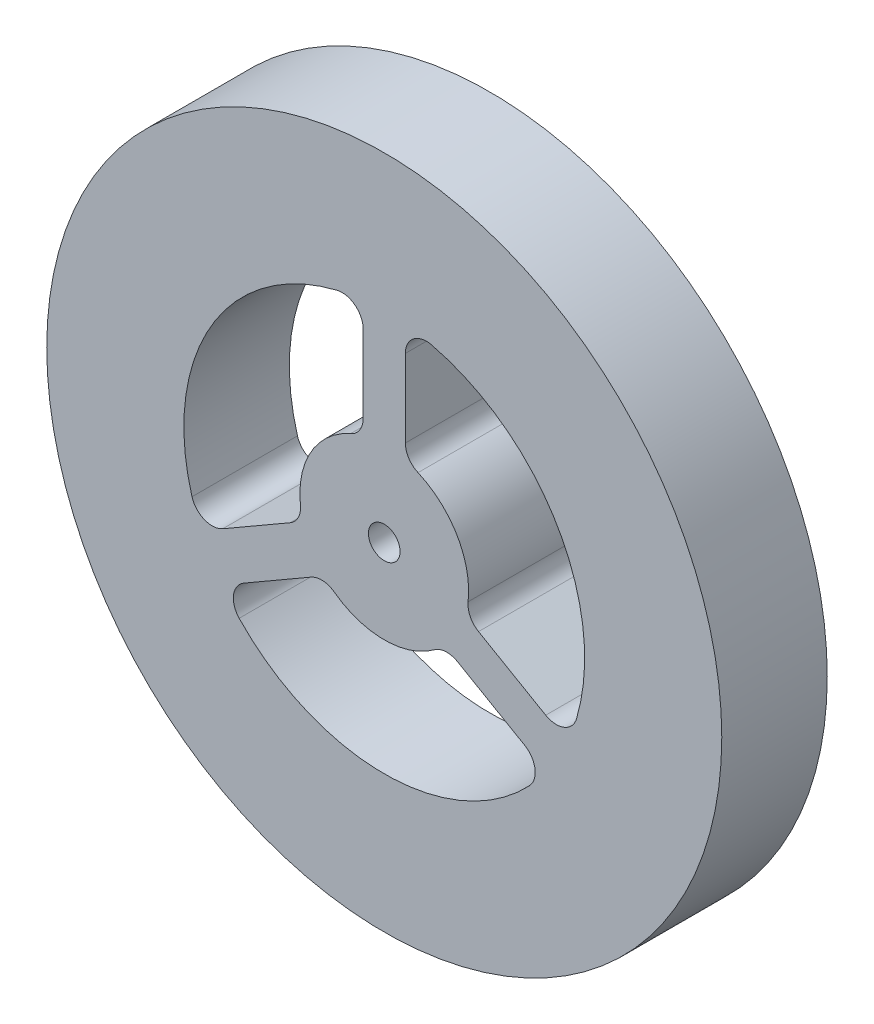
ISO-10303-21;
HEADER;
FILE_DESCRIPTION(('STEP AP214'),'2;1');
FILE_NAME('part.step','',(''),(''),'','','');
FILE_SCHEMA(('AUTOMOTIVE_DESIGN { 1 0 10303 214 1 1 1 1 }'));
ENDSEC;
DATA;
#1=APPLICATION_CONTEXT('core data for automotive mechanical design processes');
#2=APPLICATION_PROTOCOL_DEFINITION('international standard','automotive_design',2000,#1);
#3=PRODUCT_CONTEXT('',#1,'mechanical');
#4=PRODUCT('Part','Part','',(#3));
#5=PRODUCT_RELATED_PRODUCT_CATEGORY('part','',(#4));
#6=PRODUCT_DEFINITION_FORMATION('','',#4);
#7=PRODUCT_DEFINITION_CONTEXT('part definition',#1,'design');
#8=PRODUCT_DEFINITION('design','',#6,#7);
#9=PRODUCT_DEFINITION_SHAPE('','',#8);
#10=(LENGTH_UNIT() NAMED_UNIT(*) SI_UNIT(.MILLI.,.METRE.));
#11=(NAMED_UNIT(*) PLANE_ANGLE_UNIT() SI_UNIT($,.RADIAN.));
#12=(NAMED_UNIT(*) SI_UNIT($,.STERADIAN.) SOLID_ANGLE_UNIT());
#13=UNCERTAINTY_MEASURE_WITH_UNIT(LENGTH_MEASURE(1.E-05),#10,'distance_accuracy_value','');
#14=(GEOMETRIC_REPRESENTATION_CONTEXT(3) GLOBAL_UNCERTAINTY_ASSIGNED_CONTEXT((#13)) GLOBAL_UNIT_ASSIGNED_CONTEXT((#10,
#11,#12)) REPRESENTATION_CONTEXT('',''));
#15=CARTESIAN_POINT('',(0.,0.,0.));
#16=DIRECTION('',(0.,0.,1.));
#17=DIRECTION('',(1.,0.,0.));
#18=AXIS2_PLACEMENT_3D('',#15,#16,#17);
#19=CARTESIAN_POINT('',(0.,0.,5.));
#20=DIRECTION('',(0.,0.,1.));
#21=DIRECTION('',(1.,0.,0.));
#22=AXIS2_PLACEMENT_3D('',#19,#20,#21);
#23=PLANE('',#22);
#24=CARTESIAN_POINT('',(0.,0.,5.));
#25=DIRECTION('',(0.,0.,-1.));
#26=DIRECTION('',(1.,0.,0.));
#27=AXIS2_PLACEMENT_3D('',#24,#25,#26);
#28=CIRCLE('',#27,4.);
#29=CARTESIAN_POINT('',(-3.97490157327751,-0.447389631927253,5.));
#30=VERTEX_POINT('',#29);
#31=CARTESIAN_POINT('',(-1.6,3.66606055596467,5.));
#32=VERTEX_POINT('',#31);
#33=EDGE_CURVE('E261',#30,#32,#28,.T.);
#34=ORIENTED_EDGE('',*,*,#33,.F.);
#35=CARTESIAN_POINT('',(-4.96862696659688,-0.559237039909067,5.));
#36=DIRECTION('',(0.,0.,1.));
#37=DIRECTION('',(-1.,0.,0.));
#38=AXIS2_PLACEMENT_3D('',#35,#36,#37);
#39=CIRCLE('',#38,0.999999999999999);
#40=CARTESIAN_POINT('',(-4.46862696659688,-1.4252624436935,5.));
#41=VERTEX_POINT('',#40);
#42=EDGE_CURVE('E259',#41,#30,#39,.T.);
#43=ORIENTED_EDGE('',*,*,#42,.F.);
#44=DIRECTION('',(0.866025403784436,0.500000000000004,0.));
#45=VECTOR('',#44,1.);
#46=CARTESIAN_POINT('',(-7.65454401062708,-3.26465250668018,5.));
#47=LINE('',#46,#45);
#48=CARTESIAN_POINT('',(-7.65454401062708,-3.26465250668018,5.));
#49=VERTEX_POINT('',#48);
#50=EDGE_CURVE('E275',#49,#41,#47,.T.);
#51=ORIENTED_EDGE('',*,*,#50,.F.);
#52=CARTESIAN_POINT('',(-8.15454401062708,-2.39862710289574,5.));
#53=DIRECTION('',(0.,0.,1.));
#54=DIRECTION('',(-1.,0.,0.));
#55=AXIS2_PLACEMENT_3D('',#52,#53,#54);
#56=CIRCLE('',#55,1.);
#57=CARTESIAN_POINT('',(-9.11390212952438,-2.68081852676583,5.));
#58=VERTEX_POINT('',#57);
#59=EDGE_CURVE('E272',#58,#49,#56,.T.);
#60=ORIENTED_EDGE('',*,*,#59,.F.);
#61=CARTESIAN_POINT('',(0.,0.,5.));
#62=DIRECTION('',(0.,0.,1.));
#63=DIRECTION('',(1.,0.,0.));
#64=AXIS2_PLACEMENT_3D('',#61,#62,#63);
#65=CIRCLE('',#64,9.5);
#66=CARTESIAN_POINT('',(-2.23529411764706,9.23328003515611,5.));
#67=VERTEX_POINT('',#66);
#68=EDGE_CURVE('E270',#67,#58,#65,.T.);
#69=ORIENTED_EDGE('',*,*,#68,.F.);
#70=CARTESIAN_POINT('',(-2.,8.26135582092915,5.));
#71=DIRECTION('',(0.,0.,1.));
#72=DIRECTION('',(-1.,0.,0.));
#73=AXIS2_PLACEMENT_3D('',#70,#71,#72);
#74=CIRCLE('',#73,1.);
#75=CARTESIAN_POINT('',(-1.,8.26135582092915,5.));
#76=VERTEX_POINT('',#75);
#77=EDGE_CURVE('E268',#76,#67,#74,.T.);
#78=ORIENTED_EDGE('',*,*,#77,.F.);
#79=DIRECTION('',(0.,1.,0.));
#80=VECTOR('',#79,1.);
#81=CARTESIAN_POINT('',(-0.999999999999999,4.58257569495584,5.));
#82=LINE('',#81,#80);
#83=CARTESIAN_POINT('',(-0.999999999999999,4.58257569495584,5.));
#84=VERTEX_POINT('',#83);
#85=EDGE_CURVE('E266',#84,#76,#82,.T.);
#86=ORIENTED_EDGE('',*,*,#85,.F.);
#87=CARTESIAN_POINT('',(-2.,4.58257569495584,5.));
#88=DIRECTION('',(0.,0.,1.));
#89=DIRECTION('',(-1.,0.,0.));
#90=AXIS2_PLACEMENT_3D('',#87,#88,#89);
#91=CIRCLE('',#90,1.);
#92=EDGE_CURVE('E264',#32,#84,#91,.T.);
#93=ORIENTED_EDGE('',*,*,#92,.F.);
#94=EDGE_LOOP('',(#34,#43,#51,#60,#69,#78,#86,#93));
#95=FACE_BOUND('',#94,.T.);
#96=CARTESIAN_POINT('',(0.,0.,5.));
#97=DIRECTION('',(0.,0.,1.));
#98=DIRECTION('',(1.,0.,0.));
#99=AXIS2_PLACEMENT_3D('',#96,#97,#98);
#100=CIRCLE('',#99,0.75);
#101=CARTESIAN_POINT('',(0.75,0.,5.));
#102=VERTEX_POINT('',#101);
#103=EDGE_CURVE('E377',#102,#102,#100,.T.);
#104=ORIENTED_EDGE('',*,*,#103,.F.);
#105=EDGE_LOOP('',(#104));
#106=FACE_BOUND('',#105,.T.);
#107=CARTESIAN_POINT('',(0.,0.,5.));
#108=DIRECTION('',(0.,0.,1.));
#109=DIRECTION('',(1.,0.,0.));
#110=AXIS2_PLACEMENT_3D('',#107,#108,#109);
#111=CIRCLE('',#110,16.);
#112=CARTESIAN_POINT('',(16.,0.,5.));
#113=VERTEX_POINT('',#112);
#114=EDGE_CURVE('E11',#113,#113,#111,.T.);
#115=ORIENTED_EDGE('',*,*,#114,.T.);
#116=EDGE_LOOP('',(#115));
#117=FACE_BOUND('',#116,.T.);
#118=DIRECTION('',(-0.866025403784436,0.500000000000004,0.));
#119=VECTOR('',#118,1.);
#120=CARTESIAN_POINT('',(3.46862696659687,-3.15731325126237,5.));
#121=LINE('',#120,#119);
#122=CARTESIAN_POINT('',(6.65454401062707,-4.99670331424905,5.));
#123=VERTEX_POINT('',#122);
#124=CARTESIAN_POINT('',(3.46862696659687,-3.15731325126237,5.));
#125=VERTEX_POINT('',#124);
#126=EDGE_CURVE('E320',#123,#125,#121,.T.);
#127=ORIENTED_EDGE('',*,*,#126,.F.);
#128=CARTESIAN_POINT('',(6.15454401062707,-5.86272871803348,5.));
#129=DIRECTION('',(0.,0.,1.));
#130=DIRECTION('',(1.,0.,0.));
#131=AXIS2_PLACEMENT_3D('',#128,#129,#130);
#132=CIRCLE('',#131,1.);
#133=CARTESIAN_POINT('',(6.87860801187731,-6.55246150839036,5.));
#134=VERTEX_POINT('',#133);
#135=EDGE_CURVE('E318',#134,#123,#132,.T.);
#136=ORIENTED_EDGE('',*,*,#135,.F.);
#137=CARTESIAN_POINT('',(0.,0.,5.));
#138=DIRECTION('',(0.,0.,1.));
#139=DIRECTION('',(1.,0.,0.));
#140=AXIS2_PLACEMENT_3D('',#137,#138,#139);
#141=CIRCLE('',#140,9.5);
#142=CARTESIAN_POINT('',(-6.87860801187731,-6.55246150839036,5.));
#143=VERTEX_POINT('',#142);
#144=EDGE_CURVE('E334',#143,#134,#141,.T.);
#145=ORIENTED_EDGE('',*,*,#144,.F.);
#146=CARTESIAN_POINT('',(-6.15454401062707,-5.86272871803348,5.));
#147=DIRECTION('',(0.,0.,1.));
#148=DIRECTION('',(-1.,0.,0.));
#149=AXIS2_PLACEMENT_3D('',#146,#147,#148);
#150=CIRCLE('',#149,0.999999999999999);
#151=CARTESIAN_POINT('',(-6.65454401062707,-4.99670331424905,5.));
#152=VERTEX_POINT('',#151);
#153=EDGE_CURVE('E331',#152,#143,#150,.T.);
#154=ORIENTED_EDGE('',*,*,#153,.F.);
#155=DIRECTION('',(-0.866025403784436,-0.500000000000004,0.));
#156=VECTOR('',#155,1.);
#157=CARTESIAN_POINT('',(-6.65454401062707,-4.99670331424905,5.));
#158=LINE('',#157,#156);
#159=CARTESIAN_POINT('',(-3.46862696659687,-3.15731325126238,5.));
#160=VERTEX_POINT('',#159);
#161=EDGE_CURVE('E329',#160,#152,#158,.T.);
#162=ORIENTED_EDGE('',*,*,#161,.F.);
#163=CARTESIAN_POINT('',(-2.96862696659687,-4.02333865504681,5.));
#164=DIRECTION('',(0.,0.,1.));
#165=DIRECTION('',(1.,0.,0.));
#166=AXIS2_PLACEMENT_3D('',#163,#164,#165);
#167=CIRCLE('',#166,1.);
#168=CARTESIAN_POINT('',(-2.37490157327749,-3.21867092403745,5.));
#169=VERTEX_POINT('',#168);
#170=EDGE_CURVE('E327',#169,#160,#167,.T.);
#171=ORIENTED_EDGE('',*,*,#170,.F.);
#172=CARTESIAN_POINT('',(0.,0.,5.));
#173=DIRECTION('',(0.,0.,-1.));
#174=DIRECTION('',(1.,0.,0.));
#175=AXIS2_PLACEMENT_3D('',#172,#173,#174);
#176=CIRCLE('',#175,4.);
#177=CARTESIAN_POINT('',(2.37490157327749,-3.21867092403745,5.));
#178=VERTEX_POINT('',#177);
#179=EDGE_CURVE('E325',#178,#169,#176,.T.);
#180=ORIENTED_EDGE('',*,*,#179,.F.);
#181=CARTESIAN_POINT('',(2.96862696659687,-4.02333865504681,5.));
#182=DIRECTION('',(0.,0.,1.));
#183=DIRECTION('',(1.,0.,0.));
#184=AXIS2_PLACEMENT_3D('',#181,#182,#183);
#185=CIRCLE('',#184,1.);
#186=EDGE_CURVE('E323',#125,#178,#185,.T.);
#187=ORIENTED_EDGE('',*,*,#186,.F.);
#188=EDGE_LOOP('',(#127,#136,#145,#154,#162,#171,#180,#187));
#189=FACE_BOUND('',#188,.T.);
#190=CARTESIAN_POINT('',(0.,0.,5.));
#191=DIRECTION('',(0.,0.,-1.));
#192=DIRECTION('',(-1.,0.,0.));
#193=AXIS2_PLACEMENT_3D('',#190,#191,#192);
#194=CIRCLE('',#193,4.);
#195=CARTESIAN_POINT('',(1.6,3.66606055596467,5.));
#196=VERTEX_POINT('',#195);
#197=CARTESIAN_POINT('',(3.97490157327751,-0.447389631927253,5.));
#198=VERTEX_POINT('',#197);
#199=EDGE_CURVE('E202',#196,#198,#194,.T.);
#200=ORIENTED_EDGE('',*,*,#199,.F.);
#201=CARTESIAN_POINT('',(2.,4.58257569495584,5.));
#202=DIRECTION('',(0.,0.,1.));
#203=DIRECTION('',(1.,0.,0.));
#204=AXIS2_PLACEMENT_3D('',#201,#202,#203);
#205=CIRCLE('',#204,1.);
#206=CARTESIAN_POINT('',(1.,4.58257569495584,5.));
#207=VERTEX_POINT('',#206);
#208=EDGE_CURVE('E194',#207,#196,#205,.T.);
#209=ORIENTED_EDGE('',*,*,#208,.F.);
#210=DIRECTION('',(0.,-1.,0.));
#211=VECTOR('',#210,1.);
#212=CARTESIAN_POINT('',(1.,8.26135582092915,5.));
#213=LINE('',#212,#211);
#214=CARTESIAN_POINT('',(1.,8.26135582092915,5.));
#215=VERTEX_POINT('',#214);
#216=EDGE_CURVE('E227',#215,#207,#213,.T.);
#217=ORIENTED_EDGE('',*,*,#216,.F.);
#218=CARTESIAN_POINT('',(2.,8.26135582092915,5.));
#219=DIRECTION('',(0.,0.,1.));
#220=DIRECTION('',(1.,0.,0.));
#221=AXIS2_PLACEMENT_3D('',#218,#219,#220);
#222=CIRCLE('',#221,0.999999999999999);
#223=CARTESIAN_POINT('',(2.23529411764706,9.23328003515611,5.));
#224=VERTEX_POINT('',#223);
#225=EDGE_CURVE('E225',#224,#215,#222,.T.);
#226=ORIENTED_EDGE('',*,*,#225,.F.);
#227=CARTESIAN_POINT('',(0.,0.,5.));
#228=DIRECTION('',(0.,0.,1.));
#229=DIRECTION('',(-1.,0.,0.));
#230=AXIS2_PLACEMENT_3D('',#227,#228,#229);
#231=CIRCLE('',#230,9.5);
#232=CARTESIAN_POINT('',(9.11390212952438,-2.68081852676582,5.));
#233=VERTEX_POINT('',#232);
#234=EDGE_CURVE('E223',#233,#224,#231,.T.);
#235=ORIENTED_EDGE('',*,*,#234,.F.);
#236=CARTESIAN_POINT('',(8.15454401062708,-2.39862710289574,5.));
#237=DIRECTION('',(0.,0.,1.));
#238=DIRECTION('',(1.,0.,0.));
#239=AXIS2_PLACEMENT_3D('',#236,#237,#238);
#240=CIRCLE('',#239,0.999999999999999);
#241=CARTESIAN_POINT('',(7.65454401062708,-3.26465250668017,5.));
#242=VERTEX_POINT('',#241);
#243=EDGE_CURVE('E221',#242,#233,#240,.T.);
#244=ORIENTED_EDGE('',*,*,#243,.F.);
#245=DIRECTION('',(0.866025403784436,-0.500000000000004,0.));
#246=VECTOR('',#245,1.);
#247=CARTESIAN_POINT('',(4.46862696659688,-1.4252624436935,5.));
#248=LINE('',#247,#246);
#249=CARTESIAN_POINT('',(4.46862696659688,-1.4252624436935,5.));
#250=VERTEX_POINT('',#249);
#251=EDGE_CURVE('E217',#250,#242,#248,.T.);
#252=ORIENTED_EDGE('',*,*,#251,.F.);
#253=CARTESIAN_POINT('',(4.96862696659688,-0.559237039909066,5.));
#254=DIRECTION('',(0.,0.,1.));
#255=DIRECTION('',(1.,0.,0.));
#256=AXIS2_PLACEMENT_3D('',#253,#254,#255);
#257=CIRCLE('',#256,1.);
#258=EDGE_CURVE('E215',#198,#250,#257,.T.);
#259=ORIENTED_EDGE('',*,*,#258,.F.);
#260=EDGE_LOOP('',(#200,#209,#217,#226,#235,#244,#252,#259));
#261=FACE_BOUND('',#260,.T.);
#262=ADVANCED_FACE('F33',(#95,#106,#117,#189,#261),#23,.T.);
#263=CARTESIAN_POINT('',(0.,0.,0.));
#264=DIRECTION('',(0.,0.,1.));
#265=DIRECTION('',(1.,0.,0.));
#266=AXIS2_PLACEMENT_3D('',#263,#264,#265);
#267=PLANE('',#266);
#268=CARTESIAN_POINT('',(-4.96862696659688,-0.559237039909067,0.));
#269=DIRECTION('',(0.,0.,1.));
#270=DIRECTION('',(-1.,0.,0.));
#271=AXIS2_PLACEMENT_3D('',#268,#269,#270);
#272=CIRCLE('',#271,0.999999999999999);
#273=CARTESIAN_POINT('',(-4.46862696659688,-1.4252624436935,0.));
#274=VERTEX_POINT('',#273);
#275=CARTESIAN_POINT('',(-3.97490157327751,-0.447389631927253,0.));
#276=VERTEX_POINT('',#275);
#277=EDGE_CURVE('E210',#274,#276,#272,.T.);
#278=ORIENTED_EDGE('',*,*,#277,.T.);
#279=CARTESIAN_POINT('',(0.,0.,0.));
#280=DIRECTION('',(0.,0.,-1.));
#281=DIRECTION('',(1.,0.,0.));
#282=AXIS2_PLACEMENT_3D('',#279,#280,#281);
#283=CIRCLE('',#282,4.);
#284=CARTESIAN_POINT('',(-1.6,3.66606055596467,0.));
#285=VERTEX_POINT('',#284);
#286=EDGE_CURVE('E280',#276,#285,#283,.T.);
#287=ORIENTED_EDGE('',*,*,#286,.T.);
#288=CARTESIAN_POINT('',(-2.,4.58257569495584,0.));
#289=DIRECTION('',(0.,0.,1.));
#290=DIRECTION('',(-1.,0.,0.));
#291=AXIS2_PLACEMENT_3D('',#288,#289,#290);
#292=CIRCLE('',#291,1.);
#293=CARTESIAN_POINT('',(-0.999999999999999,4.58257569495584,0.));
#294=VERTEX_POINT('',#293);
#295=EDGE_CURVE('E283',#285,#294,#292,.T.);
#296=ORIENTED_EDGE('',*,*,#295,.T.);
#297=DIRECTION('',(0.,1.,0.));
#298=VECTOR('',#297,1.);
#299=CARTESIAN_POINT('',(-0.999999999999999,4.58257569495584,0.));
#300=LINE('',#299,#298);
#301=CARTESIAN_POINT('',(-1.,8.26135582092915,0.));
#302=VERTEX_POINT('',#301);
#303=EDGE_CURVE('E286',#294,#302,#300,.T.);
#304=ORIENTED_EDGE('',*,*,#303,.T.);
#305=CARTESIAN_POINT('',(-2.,8.26135582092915,0.));
#306=DIRECTION('',(0.,0.,1.));
#307=DIRECTION('',(-1.,0.,0.));
#308=AXIS2_PLACEMENT_3D('',#305,#306,#307);
#309=CIRCLE('',#308,1.);
#310=CARTESIAN_POINT('',(-2.23529411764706,9.23328003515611,0.));
#311=VERTEX_POINT('',#310);
#312=EDGE_CURVE('E289',#302,#311,#309,.T.);
#313=ORIENTED_EDGE('',*,*,#312,.T.);
#314=CARTESIAN_POINT('',(0.,0.,0.));
#315=DIRECTION('',(0.,0.,1.));
#316=DIRECTION('',(1.,0.,0.));
#317=AXIS2_PLACEMENT_3D('',#314,#315,#316);
#318=CIRCLE('',#317,9.5);
#319=CARTESIAN_POINT('',(-9.11390212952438,-2.68081852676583,0.));
#320=VERTEX_POINT('',#319);
#321=EDGE_CURVE('E292',#311,#320,#318,.T.);
#322=ORIENTED_EDGE('',*,*,#321,.T.);
#323=CARTESIAN_POINT('',(-8.15454401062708,-2.39862710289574,0.));
#324=DIRECTION('',(0.,0.,1.));
#325=DIRECTION('',(-1.,0.,0.));
#326=AXIS2_PLACEMENT_3D('',#323,#324,#325);
#327=CIRCLE('',#326,1.);
#328=CARTESIAN_POINT('',(-7.65454401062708,-3.26465250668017,0.));
#329=VERTEX_POINT('',#328);
#330=EDGE_CURVE('E295',#320,#329,#327,.T.);
#331=ORIENTED_EDGE('',*,*,#330,.T.);
#332=DIRECTION('',(0.866025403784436,0.500000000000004,0.));
#333=VECTOR('',#332,1.);
#334=CARTESIAN_POINT('',(-7.65454401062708,-3.26465250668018,0.));
#335=LINE('',#334,#333);
#336=EDGE_CURVE('E262',#329,#274,#335,.T.);
#337=ORIENTED_EDGE('',*,*,#336,.T.);
#338=EDGE_LOOP('',(#278,#287,#296,#304,#313,#322,#331,#337));
#339=FACE_BOUND('',#338,.T.);
#340=CARTESIAN_POINT('',(0.,0.,0.));
#341=DIRECTION('',(0.,0.,1.));
#342=DIRECTION('',(1.,0.,0.));
#343=AXIS2_PLACEMENT_3D('',#340,#341,#342);
#344=CIRCLE('',#343,0.75);
#345=CARTESIAN_POINT('',(0.75,0.,0.));
#346=VERTEX_POINT('',#345);
#347=EDGE_CURVE('E376',#346,#346,#344,.T.);
#348=ORIENTED_EDGE('',*,*,#347,.T.);
#349=EDGE_LOOP('',(#348));
#350=FACE_BOUND('',#349,.T.);
#351=CARTESIAN_POINT('',(0.,0.,0.));
#352=DIRECTION('',(0.,0.,1.));
#353=DIRECTION('',(1.,0.,0.));
#354=AXIS2_PLACEMENT_3D('',#351,#352,#353);
#355=CIRCLE('',#354,16.);
#356=CARTESIAN_POINT('',(16.,0.,0.));
#357=VERTEX_POINT('',#356);
#358=EDGE_CURVE('E37',#357,#357,#355,.T.);
#359=ORIENTED_EDGE('',*,*,#358,.F.);
#360=EDGE_LOOP('',(#359));
#361=FACE_BOUND('',#360,.T.);
#362=CARTESIAN_POINT('',(6.15454401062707,-5.86272871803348,0.));
#363=DIRECTION('',(0.,0.,1.));
#364=DIRECTION('',(1.,0.,0.));
#365=AXIS2_PLACEMENT_3D('',#362,#363,#364);
#366=CIRCLE('',#365,1.);
#367=CARTESIAN_POINT('',(6.87860801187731,-6.55246150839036,0.));
#368=VERTEX_POINT('',#367);
#369=CARTESIAN_POINT('',(6.65454401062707,-4.99670331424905,0.));
#370=VERTEX_POINT('',#369);
#371=EDGE_CURVE('E317',#368,#370,#366,.T.);
#372=ORIENTED_EDGE('',*,*,#371,.T.);
#373=DIRECTION('',(-0.866025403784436,0.500000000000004,0.));
#374=VECTOR('',#373,1.);
#375=CARTESIAN_POINT('',(3.46862696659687,-3.15731325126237,0.));
#376=LINE('',#375,#374);
#377=CARTESIAN_POINT('',(3.46862696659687,-3.15731325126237,0.));
#378=VERTEX_POINT('',#377);
#379=EDGE_CURVE('E339',#370,#378,#376,.T.);
#380=ORIENTED_EDGE('',*,*,#379,.T.);
#381=CARTESIAN_POINT('',(2.96862696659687,-4.02333865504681,0.));
#382=DIRECTION('',(0.,0.,1.));
#383=DIRECTION('',(1.,0.,0.));
#384=AXIS2_PLACEMENT_3D('',#381,#382,#383);
#385=CIRCLE('',#384,1.);
#386=CARTESIAN_POINT('',(2.37490157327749,-3.21867092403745,0.));
#387=VERTEX_POINT('',#386);
#388=EDGE_CURVE('E342',#378,#387,#385,.T.);
#389=ORIENTED_EDGE('',*,*,#388,.T.);
#390=CARTESIAN_POINT('',(0.,0.,0.));
#391=DIRECTION('',(0.,0.,-1.));
#392=DIRECTION('',(1.,0.,0.));
#393=AXIS2_PLACEMENT_3D('',#390,#391,#392);
#394=CIRCLE('',#393,4.);
#395=CARTESIAN_POINT('',(-2.37490157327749,-3.21867092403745,0.));
#396=VERTEX_POINT('',#395);
#397=EDGE_CURVE('E345',#387,#396,#394,.T.);
#398=ORIENTED_EDGE('',*,*,#397,.T.);
#399=CARTESIAN_POINT('',(-2.96862696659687,-4.02333865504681,0.));
#400=DIRECTION('',(0.,0.,1.));
#401=DIRECTION('',(1.,0.,0.));
#402=AXIS2_PLACEMENT_3D('',#399,#400,#401);
#403=CIRCLE('',#402,1.);
#404=CARTESIAN_POINT('',(-3.46862696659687,-3.15731325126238,0.));
#405=VERTEX_POINT('',#404);
#406=EDGE_CURVE('E348',#396,#405,#403,.T.);
#407=ORIENTED_EDGE('',*,*,#406,.T.);
#408=DIRECTION('',(-0.866025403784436,-0.500000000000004,0.));
#409=VECTOR('',#408,1.);
#410=CARTESIAN_POINT('',(-6.65454401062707,-4.99670331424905,0.));
#411=LINE('',#410,#409);
#412=CARTESIAN_POINT('',(-6.65454401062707,-4.99670331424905,0.));
#413=VERTEX_POINT('',#412);
#414=EDGE_CURVE('E351',#405,#413,#411,.T.);
#415=ORIENTED_EDGE('',*,*,#414,.T.);
#416=CARTESIAN_POINT('',(-6.15454401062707,-5.86272871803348,0.));
#417=DIRECTION('',(0.,0.,1.));
#418=DIRECTION('',(-1.,0.,0.));
#419=AXIS2_PLACEMENT_3D('',#416,#417,#418);
#420=CIRCLE('',#419,0.999999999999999);
#421=CARTESIAN_POINT('',(-6.87860801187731,-6.55246150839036,0.));
#422=VERTEX_POINT('',#421);
#423=EDGE_CURVE('E354',#413,#422,#420,.T.);
#424=ORIENTED_EDGE('',*,*,#423,.T.);
#425=CARTESIAN_POINT('',(0.,0.,0.));
#426=DIRECTION('',(0.,0.,1.));
#427=DIRECTION('',(1.,0.,0.));
#428=AXIS2_PLACEMENT_3D('',#425,#426,#427);
#429=CIRCLE('',#428,9.5);
#430=EDGE_CURVE('E321',#422,#368,#429,.T.);
#431=ORIENTED_EDGE('',*,*,#430,.T.);
#432=EDGE_LOOP('',(#372,#380,#389,#398,#407,#415,#424,#431));
#433=FACE_BOUND('',#432,.T.);
#434=CARTESIAN_POINT('',(2.,4.58257569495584,0.));
#435=DIRECTION('',(0.,0.,1.));
#436=DIRECTION('',(1.,0.,0.));
#437=AXIS2_PLACEMENT_3D('',#434,#435,#436);
#438=CIRCLE('',#437,1.);
#439=CARTESIAN_POINT('',(1.,4.58257569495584,0.));
#440=VERTEX_POINT('',#439);
#441=CARTESIAN_POINT('',(1.6,3.66606055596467,0.));
#442=VERTEX_POINT('',#441);
#443=EDGE_CURVE('E56',#440,#442,#438,.T.);
#444=ORIENTED_EDGE('',*,*,#443,.T.);
#445=CARTESIAN_POINT('',(0.,0.,0.));
#446=DIRECTION('',(0.,0.,-1.));
#447=DIRECTION('',(-1.,0.,0.));
#448=AXIS2_PLACEMENT_3D('',#445,#446,#447);
#449=CIRCLE('',#448,4.);
#450=CARTESIAN_POINT('',(3.97490157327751,-0.447389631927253,0.));
#451=VERTEX_POINT('',#450);
#452=EDGE_CURVE('E209',#442,#451,#449,.T.);
#453=ORIENTED_EDGE('',*,*,#452,.T.);
#454=CARTESIAN_POINT('',(4.96862696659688,-0.559237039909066,0.));
#455=DIRECTION('',(0.,0.,1.));
#456=DIRECTION('',(1.,0.,0.));
#457=AXIS2_PLACEMENT_3D('',#454,#455,#456);
#458=CIRCLE('',#457,1.);
#459=CARTESIAN_POINT('',(4.46862696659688,-1.4252624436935,0.));
#460=VERTEX_POINT('',#459);
#461=EDGE_CURVE('E231',#451,#460,#458,.T.);
#462=ORIENTED_EDGE('',*,*,#461,.T.);
#463=DIRECTION('',(0.866025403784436,-0.500000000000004,0.));
#464=VECTOR('',#463,1.);
#465=CARTESIAN_POINT('',(4.46862696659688,-1.4252624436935,0.));
#466=LINE('',#465,#464);
#467=CARTESIAN_POINT('',(7.65454401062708,-3.26465250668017,0.));
#468=VERTEX_POINT('',#467);
#469=EDGE_CURVE('E234',#460,#468,#466,.T.);
#470=ORIENTED_EDGE('',*,*,#469,.T.);
#471=CARTESIAN_POINT('',(8.15454401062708,-2.39862710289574,0.));
#472=DIRECTION('',(0.,0.,1.));
#473=DIRECTION('',(1.,0.,0.));
#474=AXIS2_PLACEMENT_3D('',#471,#472,#473);
#475=CIRCLE('',#474,0.999999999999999);
#476=CARTESIAN_POINT('',(9.11390212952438,-2.68081852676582,0.));
#477=VERTEX_POINT('',#476);
#478=EDGE_CURVE('E237',#468,#477,#475,.T.);
#479=ORIENTED_EDGE('',*,*,#478,.T.);
#480=CARTESIAN_POINT('',(0.,0.,0.));
#481=DIRECTION('',(0.,0.,1.));
#482=DIRECTION('',(-1.,0.,0.));
#483=AXIS2_PLACEMENT_3D('',#480,#481,#482);
#484=CIRCLE('',#483,9.5);
#485=CARTESIAN_POINT('',(2.23529411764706,9.23328003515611,0.));
#486=VERTEX_POINT('',#485);
#487=EDGE_CURVE('E240',#477,#486,#484,.T.);
#488=ORIENTED_EDGE('',*,*,#487,.T.);
#489=CARTESIAN_POINT('',(2.,8.26135582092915,0.));
#490=DIRECTION('',(0.,0.,1.));
#491=DIRECTION('',(1.,0.,0.));
#492=AXIS2_PLACEMENT_3D('',#489,#490,#491);
#493=CIRCLE('',#492,0.999999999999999);
#494=CARTESIAN_POINT('',(1.,8.26135582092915,0.));
#495=VERTEX_POINT('',#494);
#496=EDGE_CURVE('E243',#486,#495,#493,.T.);
#497=ORIENTED_EDGE('',*,*,#496,.T.);
#498=DIRECTION('',(0.,-1.,0.));
#499=VECTOR('',#498,1.);
#500=CARTESIAN_POINT('',(1.,8.26135582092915,0.));
#501=LINE('',#500,#499);
#502=EDGE_CURVE('E203',#495,#440,#501,.T.);
#503=ORIENTED_EDGE('',*,*,#502,.T.);
#504=EDGE_LOOP('',(#444,#453,#462,#470,#479,#488,#497,#503));
#505=FACE_BOUND('',#504,.T.);
#506=ADVANCED_FACE('F383',(#339,#350,#361,#433,#505),#267,.F.);
#507=CARTESIAN_POINT('',(0.,0.,5.));
#508=DIRECTION('',(0.,0.,-1.));
#509=DIRECTION('',(-1.,0.,0.));
#510=AXIS2_PLACEMENT_3D('',#507,#508,#509);
#511=CYLINDRICAL_SURFACE('',#510,16.);
#512=ORIENTED_EDGE('',*,*,#114,.F.);
#513=EDGE_LOOP('',(#512));
#514=FACE_BOUND('',#513,.T.);
#515=ORIENTED_EDGE('',*,*,#358,.T.);
#516=EDGE_LOOP('',(#515));
#517=FACE_BOUND('',#516,.T.);
#518=ADVANCED_FACE('F35',(#514,#517),#511,.T.);
#519=CARTESIAN_POINT('',(0.,0.,5.));
#520=DIRECTION('',(0.,0.,-1.));
#521=DIRECTION('',(-1.,0.,0.));
#522=AXIS2_PLACEMENT_3D('',#519,#520,#521);
#523=CYLINDRICAL_SURFACE('',#522,0.75);
#524=ORIENTED_EDGE('',*,*,#103,.T.);
#525=EDGE_LOOP('',(#524));
#526=FACE_BOUND('',#525,.T.);
#527=ORIENTED_EDGE('',*,*,#347,.F.);
#528=EDGE_LOOP('',(#527));
#529=FACE_BOUND('',#528,.T.);
#530=ADVANCED_FACE('F386',(#526,#529),#523,.F.);
#531=CARTESIAN_POINT('',(6.15454401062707,-5.86272871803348,5.));
#532=DIRECTION('',(0.,0.,-1.));
#533=DIRECTION('',(-1.,0.,0.));
#534=AXIS2_PLACEMENT_3D('',#531,#532,#533);
#535=CYLINDRICAL_SURFACE('',#534,1.);
#536=ORIENTED_EDGE('',*,*,#371,.F.);
#537=DIRECTION('',(0.,0.,-1.));
#538=VECTOR('',#537,1.);
#539=CARTESIAN_POINT('',(6.87860801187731,-6.55246150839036,5.));
#540=LINE('',#539,#538);
#541=EDGE_CURVE('E336',#134,#368,#540,.T.);
#542=ORIENTED_EDGE('',*,*,#541,.F.);
#543=ORIENTED_EDGE('',*,*,#135,.T.);
#544=DIRECTION('',(0.,0.,-1.));
#545=VECTOR('',#544,1.);
#546=CARTESIAN_POINT('',(6.65454401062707,-4.99670331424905,5.));
#547=LINE('',#546,#545);
#548=EDGE_CURVE('E373',#123,#370,#547,.T.);
#549=ORIENTED_EDGE('',*,*,#548,.T.);
#550=EDGE_LOOP('',(#536,#542,#543,#549));
#551=FACE_BOUND('',#550,.T.);
#552=ADVANCED_FACE('F388',(#551),#535,.F.);
#553=CARTESIAN_POINT('',(3.46862696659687,-3.15731325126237,5.));
#554=DIRECTION('',(-0.500000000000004,-0.866025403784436,0.));
#555=DIRECTION('',(0.866025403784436,-0.500000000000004,0.));
#556=AXIS2_PLACEMENT_3D('',#553,#554,#555);
#557=PLANE('',#556);
#558=ORIENTED_EDGE('',*,*,#379,.F.);
#559=ORIENTED_EDGE('',*,*,#548,.F.);
#560=ORIENTED_EDGE('',*,*,#126,.T.);
#561=DIRECTION('',(0.,0.,-1.));
#562=VECTOR('',#561,1.);
#563=CARTESIAN_POINT('',(3.46862696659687,-3.15731325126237,5.));
#564=LINE('',#563,#562);
#565=EDGE_CURVE('E371',#125,#378,#564,.T.);
#566=ORIENTED_EDGE('',*,*,#565,.T.);
#567=EDGE_LOOP('',(#558,#559,#560,#566));
#568=FACE_BOUND('',#567,.T.);
#569=ADVANCED_FACE('F395',(#568),#557,.T.);
#570=CARTESIAN_POINT('',(2.96862696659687,-4.02333865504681,5.));
#571=DIRECTION('',(0.,0.,-1.));
#572=DIRECTION('',(-1.,0.,0.));
#573=AXIS2_PLACEMENT_3D('',#570,#571,#572);
#574=CYLINDRICAL_SURFACE('',#573,1.);
#575=ORIENTED_EDGE('',*,*,#388,.F.);
#576=ORIENTED_EDGE('',*,*,#565,.F.);
#577=ORIENTED_EDGE('',*,*,#186,.T.);
#578=DIRECTION('',(0.,0.,-1.));
#579=VECTOR('',#578,1.);
#580=CARTESIAN_POINT('',(2.37490157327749,-3.21867092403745,5.));
#581=LINE('',#580,#579);
#582=EDGE_CURVE('E369',#178,#387,#581,.T.);
#583=ORIENTED_EDGE('',*,*,#582,.T.);
#584=EDGE_LOOP('',(#575,#576,#577,#583));
#585=FACE_BOUND('',#584,.T.);
#586=ADVANCED_FACE('F424',(#585),#574,.F.);
#587=CARTESIAN_POINT('',(0.,0.,5.));
#588=DIRECTION('',(0.,0.,-1.));
#589=DIRECTION('',(-1.,0.,0.));
#590=AXIS2_PLACEMENT_3D('',#587,#588,#589);
#591=CYLINDRICAL_SURFACE('',#590,4.);
#592=ORIENTED_EDGE('',*,*,#397,.F.);
#593=ORIENTED_EDGE('',*,*,#582,.F.);
#594=ORIENTED_EDGE('',*,*,#179,.T.);
#595=DIRECTION('',(0.,0.,-1.));
#596=VECTOR('',#595,1.);
#597=CARTESIAN_POINT('',(-2.37490157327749,-3.21867092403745,5.));
#598=LINE('',#597,#596);
#599=EDGE_CURVE('E367',#169,#396,#598,.T.);
#600=ORIENTED_EDGE('',*,*,#599,.T.);
#601=EDGE_LOOP('',(#592,#593,#594,#600));
#602=FACE_BOUND('',#601,.T.);
#603=ADVANCED_FACE('F449',(#602),#591,.T.);
#604=CARTESIAN_POINT('',(-2.96862696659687,-4.02333865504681,5.));
#605=DIRECTION('',(0.,0.,-1.));
#606=DIRECTION('',(-1.,0.,0.));
#607=AXIS2_PLACEMENT_3D('',#604,#605,#606);
#608=CYLINDRICAL_SURFACE('',#607,1.);
#609=ORIENTED_EDGE('',*,*,#406,.F.);
#610=ORIENTED_EDGE('',*,*,#599,.F.);
#611=ORIENTED_EDGE('',*,*,#170,.T.);
#612=DIRECTION('',(0.,0.,-1.));
#613=VECTOR('',#612,1.);
#614=CARTESIAN_POINT('',(-3.46862696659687,-3.15731325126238,5.));
#615=LINE('',#614,#613);
#616=EDGE_CURVE('E365',#160,#405,#615,.T.);
#617=ORIENTED_EDGE('',*,*,#616,.T.);
#618=EDGE_LOOP('',(#609,#610,#611,#617));
#619=FACE_BOUND('',#618,.T.);
#620=ADVANCED_FACE('F446',(#619),#608,.F.);
#621=CARTESIAN_POINT('',(-6.65454401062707,-4.99670331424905,5.));
#622=DIRECTION('',(0.500000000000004,-0.866025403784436,0.));
#623=DIRECTION('',(0.866025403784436,0.500000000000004,0.));
#624=AXIS2_PLACEMENT_3D('',#621,#622,#623);
#625=PLANE('',#624);
#626=ORIENTED_EDGE('',*,*,#414,.F.);
#627=ORIENTED_EDGE('',*,*,#616,.F.);
#628=ORIENTED_EDGE('',*,*,#161,.T.);
#629=DIRECTION('',(0.,0.,-1.));
#630=VECTOR('',#629,1.);
#631=CARTESIAN_POINT('',(-6.65454401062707,-4.99670331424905,5.));
#632=LINE('',#631,#630);
#633=EDGE_CURVE('E363',#152,#413,#632,.T.);
#634=ORIENTED_EDGE('',*,*,#633,.T.);
#635=EDGE_LOOP('',(#626,#627,#628,#634));
#636=FACE_BOUND('',#635,.T.);
#637=ADVANCED_FACE('F443',(#636),#625,.T.);
#638=CARTESIAN_POINT('',(-6.15454401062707,-5.86272871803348,5.));
#639=DIRECTION('',(0.,0.,-1.));
#640=DIRECTION('',(-1.,0.,0.));
#641=AXIS2_PLACEMENT_3D('',#638,#639,#640);
#642=CYLINDRICAL_SURFACE('',#641,0.999999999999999);
#643=ORIENTED_EDGE('',*,*,#423,.F.);
#644=ORIENTED_EDGE('',*,*,#633,.F.);
#645=ORIENTED_EDGE('',*,*,#153,.T.);
#646=DIRECTION('',(0.,0.,-1.));
#647=VECTOR('',#646,1.);
#648=CARTESIAN_POINT('',(-6.87860801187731,-6.55246150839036,5.));
#649=LINE('',#648,#647);
#650=EDGE_CURVE('E361',#143,#422,#649,.T.);
#651=ORIENTED_EDGE('',*,*,#650,.T.);
#652=EDGE_LOOP('',(#643,#644,#645,#651));
#653=FACE_BOUND('',#652,.T.);
#654=ADVANCED_FACE('F437',(#653),#642,.F.);
#655=CARTESIAN_POINT('',(0.,0.,5.));
#656=DIRECTION('',(0.,0.,-1.));
#657=DIRECTION('',(-1.,0.,0.));
#658=AXIS2_PLACEMENT_3D('',#655,#656,#657);
#659=CYLINDRICAL_SURFACE('',#658,9.5);
#660=ORIENTED_EDGE('',*,*,#430,.F.);
#661=ORIENTED_EDGE('',*,*,#650,.F.);
#662=ORIENTED_EDGE('',*,*,#144,.T.);
#663=ORIENTED_EDGE('',*,*,#541,.T.);
#664=EDGE_LOOP('',(#660,#661,#662,#663));
#665=FACE_BOUND('',#664,.T.);
#666=ADVANCED_FACE('F432',(#665),#659,.F.);
#667=CARTESIAN_POINT('',(-4.96862696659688,-0.559237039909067,5.));
#668=DIRECTION('',(0.,0.,-1.));
#669=DIRECTION('',(-1.,0.,0.));
#670=AXIS2_PLACEMENT_3D('',#667,#668,#669);
#671=CYLINDRICAL_SURFACE('',#670,0.999999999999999);
#672=ORIENTED_EDGE('',*,*,#277,.F.);
#673=DIRECTION('',(0.,0.,-1.));
#674=VECTOR('',#673,1.);
#675=CARTESIAN_POINT('',(-4.46862696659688,-1.4252624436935,5.));
#676=LINE('',#675,#674);
#677=EDGE_CURVE('E277',#41,#274,#676,.T.);
#678=ORIENTED_EDGE('',*,*,#677,.F.);
#679=ORIENTED_EDGE('',*,*,#42,.T.);
#680=DIRECTION('',(0.,0.,-1.));
#681=VECTOR('',#680,1.);
#682=CARTESIAN_POINT('',(-3.97490157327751,-0.447389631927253,5.));
#683=LINE('',#682,#681);
#684=EDGE_CURVE('E314',#30,#276,#683,.T.);
#685=ORIENTED_EDGE('',*,*,#684,.T.);
#686=EDGE_LOOP('',(#672,#678,#679,#685));
#687=FACE_BOUND('',#686,.T.);
#688=ADVANCED_FACE('F503',(#687),#671,.F.);
#689=CARTESIAN_POINT('',(0.,0.,5.));
#690=DIRECTION('',(0.,0.,-1.));
#691=DIRECTION('',(-1.,0.,0.));
#692=AXIS2_PLACEMENT_3D('',#689,#690,#691);
#693=CYLINDRICAL_SURFACE('',#692,4.);
#694=ORIENTED_EDGE('',*,*,#286,.F.);
#695=ORIENTED_EDGE('',*,*,#684,.F.);
#696=ORIENTED_EDGE('',*,*,#33,.T.);
#697=DIRECTION('',(0.,0.,-1.));
#698=VECTOR('',#697,1.);
#699=CARTESIAN_POINT('',(-1.6,3.66606055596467,5.));
#700=LINE('',#699,#698);
#701=EDGE_CURVE('E312',#32,#285,#700,.T.);
#702=ORIENTED_EDGE('',*,*,#701,.T.);
#703=EDGE_LOOP('',(#694,#695,#696,#702));
#704=FACE_BOUND('',#703,.T.);
#705=ADVANCED_FACE('F512',(#704),#693,.T.);
#706=CARTESIAN_POINT('',(-2.,4.58257569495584,5.));
#707=DIRECTION('',(0.,0.,-1.));
#708=DIRECTION('',(-1.,0.,0.));
#709=AXIS2_PLACEMENT_3D('',#706,#707,#708);
#710=CYLINDRICAL_SURFACE('',#709,1.);
#711=ORIENTED_EDGE('',*,*,#295,.F.);
#712=ORIENTED_EDGE('',*,*,#701,.F.);
#713=ORIENTED_EDGE('',*,*,#92,.T.);
#714=DIRECTION('',(0.,0.,-1.));
#715=VECTOR('',#714,1.);
#716=CARTESIAN_POINT('',(-0.999999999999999,4.58257569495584,5.));
#717=LINE('',#716,#715);
#718=EDGE_CURVE('E310',#84,#294,#717,.T.);
#719=ORIENTED_EDGE('',*,*,#718,.T.);
#720=EDGE_LOOP('',(#711,#712,#713,#719));
#721=FACE_BOUND('',#720,.T.);
#722=ADVANCED_FACE('F522',(#721),#710,.F.);
#723=CARTESIAN_POINT('',(-0.999999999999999,4.58257569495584,5.));
#724=DIRECTION('',(-1.,0.,0.));
#725=DIRECTION('',(0.,-1.,0.));
#726=AXIS2_PLACEMENT_3D('',#723,#724,#725);
#727=PLANE('',#726);
#728=ORIENTED_EDGE('',*,*,#303,.F.);
#729=ORIENTED_EDGE('',*,*,#718,.F.);
#730=ORIENTED_EDGE('',*,*,#85,.T.);
#731=DIRECTION('',(0.,0.,-1.));
#732=VECTOR('',#731,1.);
#733=CARTESIAN_POINT('',(-1.,8.26135582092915,5.));
#734=LINE('',#733,#732);
#735=EDGE_CURVE('E308',#76,#302,#734,.T.);
#736=ORIENTED_EDGE('',*,*,#735,.T.);
#737=EDGE_LOOP('',(#728,#729,#730,#736));
#738=FACE_BOUND('',#737,.T.);
#739=ADVANCED_FACE('F532',(#738),#727,.T.);
#740=CARTESIAN_POINT('',(-2.,8.26135582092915,5.));
#741=DIRECTION('',(0.,0.,-1.));
#742=DIRECTION('',(-1.,0.,0.));
#743=AXIS2_PLACEMENT_3D('',#740,#741,#742);
#744=CYLINDRICAL_SURFACE('',#743,1.);
#745=ORIENTED_EDGE('',*,*,#312,.F.);
#746=ORIENTED_EDGE('',*,*,#735,.F.);
#747=ORIENTED_EDGE('',*,*,#77,.T.);
#748=DIRECTION('',(0.,0.,-1.));
#749=VECTOR('',#748,1.);
#750=CARTESIAN_POINT('',(-2.23529411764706,9.23328003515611,5.));
#751=LINE('',#750,#749);
#752=EDGE_CURVE('E306',#67,#311,#751,.T.);
#753=ORIENTED_EDGE('',*,*,#752,.T.);
#754=EDGE_LOOP('',(#745,#746,#747,#753));
#755=FACE_BOUND('',#754,.T.);
#756=ADVANCED_FACE('F542',(#755),#744,.F.);
#757=CARTESIAN_POINT('',(0.,0.,5.));
#758=DIRECTION('',(0.,0.,-1.));
#759=DIRECTION('',(-1.,0.,0.));
#760=AXIS2_PLACEMENT_3D('',#757,#758,#759);
#761=CYLINDRICAL_SURFACE('',#760,9.5);
#762=ORIENTED_EDGE('',*,*,#321,.F.);
#763=ORIENTED_EDGE('',*,*,#752,.F.);
#764=ORIENTED_EDGE('',*,*,#68,.T.);
#765=DIRECTION('',(0.,0.,-1.));
#766=VECTOR('',#765,1.);
#767=CARTESIAN_POINT('',(-9.11390212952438,-2.68081852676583,5.));
#768=LINE('',#767,#766);
#769=EDGE_CURVE('E304',#58,#320,#768,.T.);
#770=ORIENTED_EDGE('',*,*,#769,.T.);
#771=EDGE_LOOP('',(#762,#763,#764,#770));
#772=FACE_BOUND('',#771,.T.);
#773=ADVANCED_FACE('F552',(#772),#761,.F.);
#774=CARTESIAN_POINT('',(-8.15454401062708,-2.39862710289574,5.));
#775=DIRECTION('',(0.,0.,-1.));
#776=DIRECTION('',(-1.,0.,0.));
#777=AXIS2_PLACEMENT_3D('',#774,#775,#776);
#778=CYLINDRICAL_SURFACE('',#777,1.);
#779=ORIENTED_EDGE('',*,*,#330,.F.);
#780=ORIENTED_EDGE('',*,*,#769,.F.);
#781=ORIENTED_EDGE('',*,*,#59,.T.);
#782=DIRECTION('',(0.,0.,-1.));
#783=VECTOR('',#782,1.);
#784=CARTESIAN_POINT('',(-7.65454401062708,-3.26465250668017,5.));
#785=LINE('',#784,#783);
#786=EDGE_CURVE('E302',#49,#329,#785,.T.);
#787=ORIENTED_EDGE('',*,*,#786,.T.);
#788=EDGE_LOOP('',(#779,#780,#781,#787));
#789=FACE_BOUND('',#788,.T.);
#790=ADVANCED_FACE('F562',(#789),#778,.F.);
#791=CARTESIAN_POINT('',(-7.65454401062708,-3.26465250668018,5.));
#792=DIRECTION('',(-0.500000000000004,0.866025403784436,0.));
#793=DIRECTION('',(-0.866025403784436,-0.500000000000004,0.));
#794=AXIS2_PLACEMENT_3D('',#791,#792,#793);
#795=PLANE('',#794);
#796=ORIENTED_EDGE('',*,*,#336,.F.);
#797=ORIENTED_EDGE('',*,*,#786,.F.);
#798=ORIENTED_EDGE('',*,*,#50,.T.);
#799=ORIENTED_EDGE('',*,*,#677,.T.);
#800=EDGE_LOOP('',(#796,#797,#798,#799));
#801=FACE_BOUND('',#800,.T.);
#802=ADVANCED_FACE('F572',(#801),#795,.T.);
#803=CARTESIAN_POINT('',(2.,4.58257569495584,5.));
#804=DIRECTION('',(0.,0.,-1.));
#805=DIRECTION('',(-1.,0.,0.));
#806=AXIS2_PLACEMENT_3D('',#803,#804,#805);
#807=CYLINDRICAL_SURFACE('',#806,1.);
#808=ORIENTED_EDGE('',*,*,#443,.F.);
#809=DIRECTION('',(0.,0.,-1.));
#810=VECTOR('',#809,1.);
#811=CARTESIAN_POINT('',(1.,4.58257569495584,5.));
#812=LINE('',#811,#810);
#813=EDGE_CURVE('E198',#207,#440,#812,.T.);
#814=ORIENTED_EDGE('',*,*,#813,.F.);
#815=ORIENTED_EDGE('',*,*,#208,.T.);
#816=DIRECTION('',(0.,0.,-1.));
#817=VECTOR('',#816,1.);
#818=CARTESIAN_POINT('',(1.6,3.66606055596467,5.));
#819=LINE('',#818,#817);
#820=EDGE_CURVE('E197',#196,#442,#819,.T.);
#821=ORIENTED_EDGE('',*,*,#820,.T.);
#822=EDGE_LOOP('',(#808,#814,#815,#821));
#823=FACE_BOUND('',#822,.T.);
#824=ADVANCED_FACE('F196',(#823),#807,.F.);
#825=CARTESIAN_POINT('',(0.,0.,5.));
#826=DIRECTION('',(0.,0.,-1.));
#827=DIRECTION('',(-1.,0.,0.));
#828=AXIS2_PLACEMENT_3D('',#825,#826,#827);
#829=CYLINDRICAL_SURFACE('',#828,4.);
#830=ORIENTED_EDGE('',*,*,#452,.F.);
#831=ORIENTED_EDGE('',*,*,#820,.F.);
#832=ORIENTED_EDGE('',*,*,#199,.T.);
#833=DIRECTION('',(0.,0.,-1.));
#834=VECTOR('',#833,1.);
#835=CARTESIAN_POINT('',(3.97490157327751,-0.447389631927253,5.));
#836=LINE('',#835,#834);
#837=EDGE_CURVE('E211',#198,#451,#836,.T.);
#838=ORIENTED_EDGE('',*,*,#837,.T.);
#839=EDGE_LOOP('',(#830,#831,#832,#838));
#840=FACE_BOUND('',#839,.T.);
#841=ADVANCED_FACE('F206',(#840),#829,.T.);
#842=CARTESIAN_POINT('',(4.96862696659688,-0.559237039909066,5.));
#843=DIRECTION('',(0.,0.,-1.));
#844=DIRECTION('',(-1.,0.,0.));
#845=AXIS2_PLACEMENT_3D('',#842,#843,#844);
#846=CYLINDRICAL_SURFACE('',#845,1.);
#847=ORIENTED_EDGE('',*,*,#461,.F.);
#848=ORIENTED_EDGE('',*,*,#837,.F.);
#849=ORIENTED_EDGE('',*,*,#258,.T.);
#850=DIRECTION('',(0.,0.,-1.));
#851=VECTOR('',#850,1.);
#852=CARTESIAN_POINT('',(4.46862696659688,-1.4252624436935,5.));
#853=LINE('',#852,#851);
#854=EDGE_CURVE('E256',#250,#460,#853,.T.);
#855=ORIENTED_EDGE('',*,*,#854,.T.);
#856=EDGE_LOOP('',(#847,#848,#849,#855));
#857=FACE_BOUND('',#856,.T.);
#858=ADVANCED_FACE('F599',(#857),#846,.F.);
#859=CARTESIAN_POINT('',(4.46862696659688,-1.4252624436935,5.));
#860=DIRECTION('',(0.500000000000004,0.866025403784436,0.));
#861=DIRECTION('',(-0.866025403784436,0.500000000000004,0.));
#862=AXIS2_PLACEMENT_3D('',#859,#860,#861);
#863=PLANE('',#862);
#864=ORIENTED_EDGE('',*,*,#469,.F.);
#865=ORIENTED_EDGE('',*,*,#854,.F.);
#866=ORIENTED_EDGE('',*,*,#251,.T.);
#867=DIRECTION('',(0.,0.,-1.));
#868=VECTOR('',#867,1.);
#869=CARTESIAN_POINT('',(7.65454401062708,-3.26465250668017,5.));
#870=LINE('',#869,#868);
#871=EDGE_CURVE('E254',#242,#468,#870,.T.);
#872=ORIENTED_EDGE('',*,*,#871,.T.);
#873=EDGE_LOOP('',(#864,#865,#866,#872));
#874=FACE_BOUND('',#873,.T.);
#875=ADVANCED_FACE('F608',(#874),#863,.T.);
#876=CARTESIAN_POINT('',(8.15454401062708,-2.39862710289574,5.));
#877=DIRECTION('',(0.,0.,-1.));
#878=DIRECTION('',(-1.,0.,0.));
#879=AXIS2_PLACEMENT_3D('',#876,#877,#878);
#880=CYLINDRICAL_SURFACE('',#879,0.999999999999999);
#881=ORIENTED_EDGE('',*,*,#478,.F.);
#882=ORIENTED_EDGE('',*,*,#871,.F.);
#883=ORIENTED_EDGE('',*,*,#243,.T.);
#884=DIRECTION('',(0.,0.,-1.));
#885=VECTOR('',#884,1.);
#886=CARTESIAN_POINT('',(9.11390212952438,-2.68081852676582,5.));
#887=LINE('',#886,#885);
#888=EDGE_CURVE('E252',#233,#477,#887,.T.);
#889=ORIENTED_EDGE('',*,*,#888,.T.);
#890=EDGE_LOOP('',(#881,#882,#883,#889));
#891=FACE_BOUND('',#890,.T.);
#892=ADVANCED_FACE('F618',(#891),#880,.F.);
#893=CARTESIAN_POINT('',(0.,0.,5.));
#894=DIRECTION('',(0.,0.,-1.));
#895=DIRECTION('',(-1.,0.,0.));
#896=AXIS2_PLACEMENT_3D('',#893,#894,#895);
#897=CYLINDRICAL_SURFACE('',#896,9.5);
#898=ORIENTED_EDGE('',*,*,#487,.F.);
#899=ORIENTED_EDGE('',*,*,#888,.F.);
#900=ORIENTED_EDGE('',*,*,#234,.T.);
#901=DIRECTION('',(0.,0.,-1.));
#902=VECTOR('',#901,1.);
#903=CARTESIAN_POINT('',(2.23529411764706,9.23328003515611,5.));
#904=LINE('',#903,#902);
#905=EDGE_CURVE('E250',#224,#486,#904,.T.);
#906=ORIENTED_EDGE('',*,*,#905,.T.);
#907=EDGE_LOOP('',(#898,#899,#900,#906));
#908=FACE_BOUND('',#907,.T.);
#909=ADVANCED_FACE('F628',(#908),#897,.F.);
#910=CARTESIAN_POINT('',(2.,8.26135582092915,5.));
#911=DIRECTION('',(0.,0.,-1.));
#912=DIRECTION('',(-1.,0.,0.));
#913=AXIS2_PLACEMENT_3D('',#910,#911,#912);
#914=CYLINDRICAL_SURFACE('',#913,0.999999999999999);
#915=ORIENTED_EDGE('',*,*,#496,.F.);
#916=ORIENTED_EDGE('',*,*,#905,.F.);
#917=ORIENTED_EDGE('',*,*,#225,.T.);
#918=DIRECTION('',(0.,0.,-1.));
#919=VECTOR('',#918,1.);
#920=CARTESIAN_POINT('',(1.,8.26135582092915,5.));
#921=LINE('',#920,#919);
#922=EDGE_CURVE('E48',#215,#495,#921,.T.);
#923=ORIENTED_EDGE('',*,*,#922,.T.);
#924=EDGE_LOOP('',(#915,#916,#917,#923));
#925=FACE_BOUND('',#924,.T.);
#926=ADVANCED_FACE('F638',(#925),#914,.F.);
#927=CARTESIAN_POINT('',(1.,8.26135582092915,5.));
#928=DIRECTION('',(1.,0.,0.));
#929=DIRECTION('',(0.,1.,0.));
#930=AXIS2_PLACEMENT_3D('',#927,#928,#929);
#931=PLANE('',#930);
#932=ORIENTED_EDGE('',*,*,#502,.F.);
#933=ORIENTED_EDGE('',*,*,#922,.F.);
#934=ORIENTED_EDGE('',*,*,#216,.T.);
#935=ORIENTED_EDGE('',*,*,#813,.T.);
#936=EDGE_LOOP('',(#932,#933,#934,#935));
#937=FACE_BOUND('',#936,.T.);
#938=ADVANCED_FACE('F648',(#937),#931,.T.);
#939=CLOSED_SHELL('',(#262,#506,#518,#530,#552,#569,#586,#603,#620,#637,#654,#666,#688,#705,
#722,#739,#756,#773,#790,#802,#824,#841,#858,#875,#892,#909,#926,#938));
#940=MANIFOLD_SOLID_BREP('B2',#939);
#941=ADVANCED_BREP_SHAPE_REPRESENTATION('',(#18,#940),#14);
#942=SHAPE_DEFINITION_REPRESENTATION(#9,#941);
ENDSEC;
END-ISO-10303-21;
